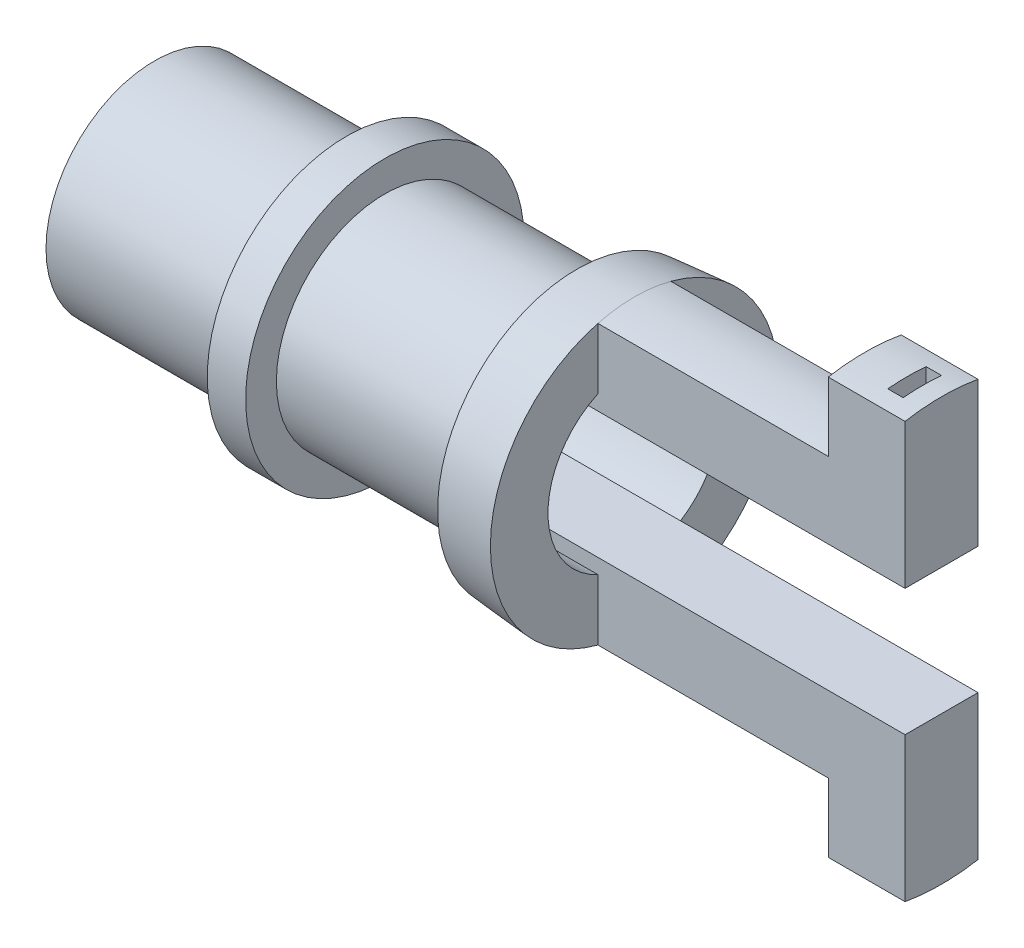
ISO-10303-21;
HEADER;
FILE_DESCRIPTION(('STEP AP214'),'2;1');
FILE_NAME('part.step','',(''),(''),'','','');
FILE_SCHEMA(('AUTOMOTIVE_DESIGN { 1 0 10303 214 1 1 1 1 }'));
ENDSEC;
DATA;
#1=APPLICATION_CONTEXT('core data for automotive mechanical design processes');
#2=APPLICATION_PROTOCOL_DEFINITION('international standard','automotive_design',2000,#1);
#3=PRODUCT_CONTEXT('',#1,'mechanical');
#4=PRODUCT('Part','Part','',(#3));
#5=PRODUCT_RELATED_PRODUCT_CATEGORY('part','',(#4));
#6=PRODUCT_DEFINITION_FORMATION('','',#4);
#7=PRODUCT_DEFINITION_CONTEXT('part definition',#1,'design');
#8=PRODUCT_DEFINITION('design','',#6,#7);
#9=PRODUCT_DEFINITION_SHAPE('','',#8);
#10=(LENGTH_UNIT() NAMED_UNIT(*) SI_UNIT(.MILLI.,.METRE.));
#11=(NAMED_UNIT(*) PLANE_ANGLE_UNIT() SI_UNIT($,.RADIAN.));
#12=(NAMED_UNIT(*) SI_UNIT($,.STERADIAN.) SOLID_ANGLE_UNIT());
#13=UNCERTAINTY_MEASURE_WITH_UNIT(LENGTH_MEASURE(1.E-05),#10,'distance_accuracy_value','');
#14=(GEOMETRIC_REPRESENTATION_CONTEXT(3) GLOBAL_UNCERTAINTY_ASSIGNED_CONTEXT((#13)) GLOBAL_UNIT_ASSIGNED_CONTEXT((#10,
#11,#12)) REPRESENTATION_CONTEXT('',''));
#15=CARTESIAN_POINT('',(0.,0.,0.));
#16=DIRECTION('',(0.,0.,1.));
#17=DIRECTION('',(1.,0.,0.));
#18=AXIS2_PLACEMENT_3D('',#15,#16,#17);
#19=CARTESIAN_POINT('',(0.,4.5,0.));
#20=DIRECTION('',(-1.,0.,0.));
#21=DIRECTION('',(0.,0.,1.));
#22=AXIS2_PLACEMENT_3D('',#19,#20,#21);
#23=PLANE('',#22);
#24=CARTESIAN_POINT('',(0.,0.,0.));
#25=DIRECTION('',(1.,0.,0.));
#26=DIRECTION('',(0.,0.,-1.));
#27=AXIS2_PLACEMENT_3D('',#24,#25,#26);
#28=CIRCLE('',#27,5.65);
#29=CARTESIAN_POINT('',(0.,0.,-5.65));
#30=VERTEX_POINT('',#29);
#31=EDGE_CURVE('E383',#30,#30,#28,.T.);
#32=ORIENTED_EDGE('',*,*,#31,.F.);
#33=EDGE_LOOP('',(#32));
#34=FACE_BOUND('',#33,.T.);
#35=CARTESIAN_POINT('',(0.,0.,0.));
#36=DIRECTION('',(1.,0.,0.));
#37=DIRECTION('',(0.,0.,-1.));
#38=AXIS2_PLACEMENT_3D('',#35,#36,#37);
#39=CIRCLE('',#38,4.5);
#40=CARTESIAN_POINT('',(0.,4.07921561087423,1.90000000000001));
#41=VERTEX_POINT('',#40);
#42=CARTESIAN_POINT('',(0.,-4.07921561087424,1.89999999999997));
#43=VERTEX_POINT('',#42);
#44=EDGE_CURVE('E381',#41,#43,#39,.T.);
#45=ORIENTED_EDGE('',*,*,#44,.T.);
#46=DIRECTION('',(0.,1.,0.));
#47=VECTOR('',#46,1.);
#48=CARTESIAN_POINT('',(0.,-3.30000000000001,1.89999999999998));
#49=LINE('',#48,#47);
#50=CARTESIAN_POINT('',(0.,-3.30000000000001,1.89999999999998));
#51=VERTEX_POINT('',#50);
#52=EDGE_CURVE('E218',#43,#51,#49,.T.);
#53=ORIENTED_EDGE('',*,*,#52,.T.);
#54=DIRECTION('',(0.,0.,-1.));
#55=VECTOR('',#54,1.);
#56=CARTESIAN_POINT('',(0.,-3.29999999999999,-1.90000000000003));
#57=LINE('',#56,#55);
#58=CARTESIAN_POINT('',(0.,-3.29999999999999,-1.90000000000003));
#59=VERTEX_POINT('',#58);
#60=EDGE_CURVE('E226',#51,#59,#57,.T.);
#61=ORIENTED_EDGE('',*,*,#60,.T.);
#62=DIRECTION('',(0.,-1.,0.));
#63=VECTOR('',#62,1.);
#64=CARTESIAN_POINT('',(0.,-4.07921561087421,-1.90000000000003));
#65=LINE('',#64,#63);
#66=CARTESIAN_POINT('',(0.,-4.07921561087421,-1.90000000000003));
#67=VERTEX_POINT('',#66);
#68=EDGE_CURVE('E229',#59,#67,#65,.T.);
#69=ORIENTED_EDGE('',*,*,#68,.T.);
#70=CARTESIAN_POINT('',(0.,4.07921561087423,-1.9));
#71=VERTEX_POINT('',#70);
#72=EDGE_CURVE('E351',#67,#71,#39,.T.);
#73=ORIENTED_EDGE('',*,*,#72,.T.);
#74=DIRECTION('',(0.,-1.,0.));
#75=VECTOR('',#74,1.);
#76=CARTESIAN_POINT('',(0.,3.3,-1.9));
#77=LINE('',#76,#75);
#78=CARTESIAN_POINT('',(0.,3.3,-1.9));
#79=VERTEX_POINT('',#78);
#80=EDGE_CURVE('E250',#71,#79,#77,.T.);
#81=ORIENTED_EDGE('',*,*,#80,.T.);
#82=DIRECTION('',(0.,0.,1.));
#83=VECTOR('',#82,1.);
#84=CARTESIAN_POINT('',(0.,3.3,1.90000000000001));
#85=LINE('',#84,#83);
#86=CARTESIAN_POINT('',(0.,3.3,1.90000000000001));
#87=VERTEX_POINT('',#86);
#88=EDGE_CURVE('E247',#79,#87,#85,.T.);
#89=ORIENTED_EDGE('',*,*,#88,.T.);
#90=DIRECTION('',(0.,1.,0.));
#91=VECTOR('',#90,1.);
#92=CARTESIAN_POINT('',(0.,4.07921561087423,1.90000000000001));
#93=LINE('',#92,#91);
#94=EDGE_CURVE('E244',#87,#41,#93,.T.);
#95=ORIENTED_EDGE('',*,*,#94,.T.);
#96=EDGE_LOOP('',(#45,#53,#61,#69,#73,#81,#89,#95));
#97=FACE_BOUND('',#96,.T.);
#98=DIRECTION('',(0.,0.,1.));
#99=VECTOR('',#98,1.);
#100=CARTESIAN_POINT('',(0.,4.,0.));
#101=LINE('',#100,#99);
#102=CARTESIAN_POINT('',(0.,4.,-1.));
#103=VERTEX_POINT('',#102);
#104=CARTESIAN_POINT('',(0.,4.,1.));
#105=VERTEX_POINT('',#104);
#106=EDGE_CURVE('E11',#103,#105,#101,.T.);
#107=ORIENTED_EDGE('',*,*,#106,.F.);
#108=DIRECTION('',(0.,1.,0.));
#109=VECTOR('',#108,1.);
#110=CARTESIAN_POINT('',(0.,4.5,-1.));
#111=LINE('',#110,#109);
#112=CARTESIAN_POINT('',(0.,4.8,-1.));
#113=VERTEX_POINT('',#112);
#114=EDGE_CURVE('E216',#103,#113,#111,.T.);
#115=ORIENTED_EDGE('',*,*,#114,.T.);
#116=DIRECTION('',(0.,0.,-1.));
#117=VECTOR('',#116,1.);
#118=CARTESIAN_POINT('',(0.,4.8,0.));
#119=LINE('',#118,#117);
#120=CARTESIAN_POINT('',(0.,4.8,1.));
#121=VERTEX_POINT('',#120);
#122=EDGE_CURVE('E39',#121,#113,#119,.T.);
#123=ORIENTED_EDGE('',*,*,#122,.F.);
#124=DIRECTION('',(0.,1.,0.));
#125=VECTOR('',#124,1.);
#126=CARTESIAN_POINT('',(0.,4.5,1.));
#127=LINE('',#126,#125);
#128=EDGE_CURVE('E213',#105,#121,#127,.T.);
#129=ORIENTED_EDGE('',*,*,#128,.F.);
#130=EDGE_LOOP('',(#107,#115,#123,#129));
#131=FACE_BOUND('',#130,.T.);
#132=ADVANCED_FACE('F31',(#34,#97,#131),#23,.T.);
#133=CARTESIAN_POINT('',(41.,0.,0.));
#134=DIRECTION('',(-1.,0.,0.));
#135=DIRECTION('',(0.,0.,1.));
#136=AXIS2_PLACEMENT_3D('',#133,#134,#135);
#137=CYLINDRICAL_SURFACE('',#136,11.);
#138=CARTESIAN_POINT('',(37.,0.,0.));
#139=DIRECTION('',(1.,0.,0.));
#140=DIRECTION('',(0.,0.,-1.));
#141=AXIS2_PLACEMENT_3D('',#138,#139,#140);
#142=CIRCLE('',#141,11.);
#143=CARTESIAN_POINT('',(37.,10.8346665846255,-1.9));
#144=VERTEX_POINT('',#143);
#145=CARTESIAN_POINT('',(37.,10.8346665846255,1.9));
#146=VERTEX_POINT('',#145);
#147=EDGE_CURVE('E310',#144,#146,#142,.T.);
#148=ORIENTED_EDGE('',*,*,#147,.T.);
#149=DIRECTION('',(-1.,0.,0.));
#150=VECTOR('',#149,1.);
#151=CARTESIAN_POINT('',(41.,10.8346665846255,1.9));
#152=LINE('',#151,#150);
#153=CARTESIAN_POINT('',(41.,10.8346665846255,1.9));
#154=VERTEX_POINT('',#153);
#155=EDGE_CURVE('E307',#154,#146,#152,.T.);
#156=ORIENTED_EDGE('',*,*,#155,.F.);
#157=CARTESIAN_POINT('',(41.,0.,0.));
#158=DIRECTION('',(1.,0.,0.));
#159=DIRECTION('',(0.,0.,-1.));
#160=AXIS2_PLACEMENT_3D('',#157,#158,#159);
#161=CIRCLE('',#160,11.);
#162=CARTESIAN_POINT('',(41.,10.8346665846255,-1.9));
#163=VERTEX_POINT('',#162);
#164=EDGE_CURVE('E302',#163,#154,#161,.T.);
#165=ORIENTED_EDGE('',*,*,#164,.F.);
#166=DIRECTION('',(-1.,0.,0.));
#167=VECTOR('',#166,1.);
#168=CARTESIAN_POINT('',(41.,10.8346665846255,-1.9));
#169=LINE('',#168,#167);
#170=EDGE_CURVE('E355',#163,#144,#169,.T.);
#171=ORIENTED_EDGE('',*,*,#170,.T.);
#172=EDGE_LOOP('',(#148,#156,#165,#171));
#173=FACE_BOUND('',#172,.T.);
#174=DIRECTION('',(-1.,0.,0.));
#175=VECTOR('',#174,1.);
#176=CARTESIAN_POINT('',(41.,10.9544511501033,-1.));
#177=LINE('',#176,#175);
#178=CARTESIAN_POINT('',(40.,10.9544511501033,-1.));
#179=VERTEX_POINT('',#178);
#180=CARTESIAN_POINT('',(39.2,10.9544511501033,-1.));
#181=VERTEX_POINT('',#180);
#182=EDGE_CURVE('E186',#179,#181,#177,.T.);
#183=ORIENTED_EDGE('',*,*,#182,.F.);
#184=CARTESIAN_POINT('',(40.,0.,0.));
#185=DIRECTION('',(1.,0.,0.));
#186=DIRECTION('',(0.,0.,-1.));
#187=AXIS2_PLACEMENT_3D('',#184,#185,#186);
#188=CIRCLE('',#187,11.);
#189=CARTESIAN_POINT('',(40.,10.9544511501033,1.));
#190=VERTEX_POINT('',#189);
#191=EDGE_CURVE('E392',#179,#190,#188,.T.);
#192=ORIENTED_EDGE('',*,*,#191,.T.);
#193=DIRECTION('',(-1.,0.,0.));
#194=VECTOR('',#193,1.);
#195=CARTESIAN_POINT('',(41.,10.9544511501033,1.));
#196=LINE('',#195,#194);
#197=CARTESIAN_POINT('',(39.2,10.9544511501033,1.));
#198=VERTEX_POINT('',#197);
#199=EDGE_CURVE('E385',#190,#198,#196,.T.);
#200=ORIENTED_EDGE('',*,*,#199,.T.);
#201=CARTESIAN_POINT('',(39.2,0.,0.));
#202=DIRECTION('',(-1.,0.,0.));
#203=DIRECTION('',(0.,0.,1.));
#204=AXIS2_PLACEMENT_3D('',#201,#202,#203);
#205=CIRCLE('',#204,11.);
#206=EDGE_CURVE('E389',#198,#181,#205,.T.);
#207=ORIENTED_EDGE('',*,*,#206,.T.);
#208=EDGE_LOOP('',(#183,#192,#200,#207));
#209=FACE_BOUND('',#208,.T.);
#210=ADVANCED_FACE('F396',(#173,#209),#137,.T.);
#211=CARTESIAN_POINT('',(0.,0.,0.));
#212=DIRECTION('',(1.,0.,0.));
#213=DIRECTION('',(0.,0.,-1.));
#214=AXIS2_PLACEMENT_3D('',#211,#212,#213);
#215=CYLINDRICAL_SURFACE('',#214,4.5);
#216=DIRECTION('',(-1.,0.,0.));
#217=VECTOR('',#216,1.);
#218=CARTESIAN_POINT('',(44.9849717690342,-4.07921561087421,-1.90000000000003));
#219=LINE('',#218,#217);
#220=CARTESIAN_POINT('',(25.,-4.07921561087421,-1.90000000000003));
#221=VERTEX_POINT('',#220);
#222=EDGE_CURVE('E223',#221,#67,#219,.T.);
#223=ORIENTED_EDGE('',*,*,#222,.F.);
#224=CARTESIAN_POINT('',(25.,0.,0.));
#225=DIRECTION('',(1.,0.,0.));
#226=DIRECTION('',(0.,0.,-1.));
#227=AXIS2_PLACEMENT_3D('',#224,#225,#226);
#228=CIRCLE('',#227,4.5);
#229=CARTESIAN_POINT('',(25.,4.07921561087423,-1.9));
#230=VERTEX_POINT('',#229);
#231=EDGE_CURVE('E334',#221,#230,#228,.T.);
#232=ORIENTED_EDGE('',*,*,#231,.T.);
#233=DIRECTION('',(-1.,0.,0.));
#234=VECTOR('',#233,1.);
#235=CARTESIAN_POINT('',(44.9849717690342,4.07921561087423,-1.9));
#236=LINE('',#235,#234);
#237=EDGE_CURVE('E222',#230,#71,#236,.T.);
#238=ORIENTED_EDGE('',*,*,#237,.T.);
#239=ORIENTED_EDGE('',*,*,#72,.F.);
#240=EDGE_LOOP('',(#223,#232,#238,#239));
#241=FACE_BOUND('',#240,.T.);
#242=ADVANCED_FACE('F421',(#241),#215,.F.);
#243=CARTESIAN_POINT('',(25.,7.5,0.));
#244=DIRECTION('',(1.,0.,0.));
#245=DIRECTION('',(0.,0.,-1.));
#246=AXIS2_PLACEMENT_3D('',#243,#244,#245);
#247=PLANE('',#246);
#248=CARTESIAN_POINT('',(25.,0.,0.));
#249=DIRECTION('',(1.,0.,0.));
#250=DIRECTION('',(0.,0.,-1.));
#251=AXIS2_PLACEMENT_3D('',#248,#249,#250);
#252=CIRCLE('',#251,7.5);
#253=CARTESIAN_POINT('',(25.,7.25534285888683,1.9));
#254=VERTEX_POINT('',#253);
#255=CARTESIAN_POINT('',(25.,-7.25534285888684,1.89999999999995));
#256=VERTEX_POINT('',#255);
#257=EDGE_CURVE('E332',#254,#256,#252,.T.);
#258=ORIENTED_EDGE('',*,*,#257,.T.);
#259=DIRECTION('',(0.,-1.,0.));
#260=VECTOR('',#259,1.);
#261=CARTESIAN_POINT('',(25.,-4.07921561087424,1.89999999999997));
#262=LINE('',#261,#260);
#263=CARTESIAN_POINT('',(25.,-4.07921561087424,1.89999999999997));
#264=VERTEX_POINT('',#263);
#265=EDGE_CURVE('E281',#264,#256,#262,.T.);
#266=ORIENTED_EDGE('',*,*,#265,.F.);
#267=CARTESIAN_POINT('',(25.,4.07921561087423,1.90000000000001));
#268=VERTEX_POINT('',#267);
#269=EDGE_CURVE('E347',#268,#264,#228,.T.);
#270=ORIENTED_EDGE('',*,*,#269,.F.);
#271=DIRECTION('',(0.,-1.,0.));
#272=VECTOR('',#271,1.);
#273=CARTESIAN_POINT('',(25.,7.25534285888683,1.9));
#274=LINE('',#273,#272);
#275=EDGE_CURVE('E326',#254,#268,#274,.T.);
#276=ORIENTED_EDGE('',*,*,#275,.F.);
#277=EDGE_LOOP('',(#258,#266,#270,#276));
#278=FACE_BOUND('',#277,.T.);
#279=ADVANCED_FACE('F431',(#278),#247,.T.);
#280=ORIENTED_EDGE('',*,*,#231,.F.);
#281=DIRECTION('',(0.,1.,0.));
#282=VECTOR('',#281,1.);
#283=CARTESIAN_POINT('',(25.,-7.25534285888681,-1.90000000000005));
#284=LINE('',#283,#282);
#285=CARTESIAN_POINT('',(25.,-7.25534285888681,-1.90000000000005));
#286=VERTEX_POINT('',#285);
#287=EDGE_CURVE('E286',#286,#221,#284,.T.);
#288=ORIENTED_EDGE('',*,*,#287,.F.);
#289=CARTESIAN_POINT('',(25.,7.25534285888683,-1.9));
#290=VERTEX_POINT('',#289);
#291=EDGE_CURVE('E329',#286,#290,#252,.T.);
#292=ORIENTED_EDGE('',*,*,#291,.T.);
#293=DIRECTION('',(0.,1.,0.));
#294=VECTOR('',#293,1.);
#295=CARTESIAN_POINT('',(25.,4.07921561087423,-1.9));
#296=LINE('',#295,#294);
#297=EDGE_CURVE('E352',#230,#290,#296,.T.);
#298=ORIENTED_EDGE('',*,*,#297,.F.);
#299=EDGE_LOOP('',(#280,#288,#292,#298));
#300=FACE_BOUND('',#299,.T.);
#301=ADVANCED_FACE('F434',(#300),#247,.T.);
#302=CARTESIAN_POINT('',(0.,0.,0.));
#303=DIRECTION('',(1.,0.,0.));
#304=DIRECTION('',(0.,0.,-1.));
#305=AXIS2_PLACEMENT_3D('',#302,#303,#304);
#306=CYLINDRICAL_SURFACE('',#305,5.65);
#307=ORIENTED_EDGE('',*,*,#31,.T.);
#308=EDGE_LOOP('',(#307));
#309=FACE_BOUND('',#308,.T.);
#310=CARTESIAN_POINT('',(10.,0.,0.));
#311=DIRECTION('',(1.,0.,0.));
#312=DIRECTION('',(0.,0.,-1.));
#313=AXIS2_PLACEMENT_3D('',#310,#311,#312);
#314=CIRCLE('',#313,5.65);
#315=CARTESIAN_POINT('',(10.,0.,-5.65));
#316=VERTEX_POINT('',#315);
#317=EDGE_CURVE('E359',#316,#316,#314,.T.);
#318=ORIENTED_EDGE('',*,*,#317,.F.);
#319=EDGE_LOOP('',(#318));
#320=FACE_BOUND('',#319,.T.);
#321=ADVANCED_FACE('F33',(#309,#320),#306,.T.);
#322=DIRECTION('',(-1.,0.,0.));
#323=VECTOR('',#322,1.);
#324=CARTESIAN_POINT('',(44.9849717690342,-4.07921561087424,1.89999999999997));
#325=LINE('',#324,#323);
#326=EDGE_CURVE('E232',#264,#43,#325,.T.);
#327=ORIENTED_EDGE('',*,*,#326,.T.);
#328=ORIENTED_EDGE('',*,*,#44,.F.);
#329=DIRECTION('',(-1.,0.,0.));
#330=VECTOR('',#329,1.);
#331=CARTESIAN_POINT('',(44.9849717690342,4.07921561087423,1.90000000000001));
#332=LINE('',#331,#330);
#333=EDGE_CURVE('E259',#268,#41,#332,.T.);
#334=ORIENTED_EDGE('',*,*,#333,.F.);
#335=ORIENTED_EDGE('',*,*,#269,.T.);
#336=EDGE_LOOP('',(#327,#328,#334,#335));
#337=FACE_BOUND('',#336,.T.);
#338=ADVANCED_FACE('F426',(#337),#215,.F.);
#339=CARTESIAN_POINT('',(25.,0.,0.));
#340=DIRECTION('',(1.,0.,0.));
#341=DIRECTION('',(0.,0.,-1.));
#342=AXIS2_PLACEMENT_3D('',#339,#340,#341);
#343=CONICAL_SURFACE('',#342,7.5,0.0831412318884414);
#344=CARTESIAN_POINT('',(22.,0.,0.));
#345=DIRECTION('',(1.,0.,0.));
#346=DIRECTION('',(0.,0.,-1.));
#347=AXIS2_PLACEMENT_3D('',#344,#345,#346);
#348=CIRCLE('',#347,7.25);
#349=CARTESIAN_POINT('',(22.,0.,-7.25));
#350=VERTEX_POINT('',#349);
#351=EDGE_CURVE('E333',#350,#350,#348,.T.);
#352=ORIENTED_EDGE('',*,*,#351,.T.);
#353=EDGE_LOOP('',(#352));
#354=FACE_BOUND('',#353,.T.);
#355=EDGE_CURVE('E340',#290,#254,#252,.T.);
#356=ORIENTED_EDGE('',*,*,#355,.F.);
#357=ORIENTED_EDGE('',*,*,#291,.F.);
#358=CARTESIAN_POINT('',(25.,0.,0.));
#359=DIRECTION('',(1.,0.,0.));
#360=DIRECTION('',(0.,0.,1.));
#361=AXIS2_PLACEMENT_3D('',#358,#359,#360);
#362=CIRCLE('',#361,7.5);
#363=EDGE_CURVE('E289',#256,#286,#362,.T.);
#364=ORIENTED_EDGE('',*,*,#363,.F.);
#365=ORIENTED_EDGE('',*,*,#257,.F.);
#366=EDGE_LOOP('',(#356,#357,#364,#365));
#367=FACE_BOUND('',#366,.T.);
#368=ADVANCED_FACE('F429',(#354,#367),#343,.T.);
#369=CARTESIAN_POINT('',(22.,5.65,0.));
#370=DIRECTION('',(-1.,0.,0.));
#371=DIRECTION('',(0.,0.,1.));
#372=AXIS2_PLACEMENT_3D('',#369,#370,#371);
#373=PLANE('',#372);
#374=CARTESIAN_POINT('',(22.,0.,0.));
#375=DIRECTION('',(1.,0.,0.));
#376=DIRECTION('',(0.,0.,-1.));
#377=AXIS2_PLACEMENT_3D('',#374,#375,#376);
#378=CIRCLE('',#377,5.65);
#379=CARTESIAN_POINT('',(22.,0.,-5.65));
#380=VERTEX_POINT('',#379);
#381=EDGE_CURVE('E376',#380,#380,#378,.T.);
#382=ORIENTED_EDGE('',*,*,#381,.T.);
#383=EDGE_LOOP('',(#382));
#384=FACE_BOUND('',#383,.T.);
#385=ORIENTED_EDGE('',*,*,#351,.F.);
#386=EDGE_LOOP('',(#385));
#387=FACE_BOUND('',#386,.T.);
#388=ADVANCED_FACE('F438',(#384,#387),#373,.T.);
#389=CARTESIAN_POINT('',(0.,0.,0.));
#390=DIRECTION('',(1.,0.,0.));
#391=DIRECTION('',(0.,0.,-1.));
#392=AXIS2_PLACEMENT_3D('',#389,#390,#391);
#393=CYLINDRICAL_SURFACE('',#392,5.65);
#394=CARTESIAN_POINT('',(12.,0.,0.));
#395=DIRECTION('',(1.,0.,0.));
#396=DIRECTION('',(0.,0.,-1.));
#397=AXIS2_PLACEMENT_3D('',#394,#395,#396);
#398=CIRCLE('',#397,5.65);
#399=CARTESIAN_POINT('',(12.,0.,-5.65));
#400=VERTEX_POINT('',#399);
#401=EDGE_CURVE('E373',#400,#400,#398,.T.);
#402=ORIENTED_EDGE('',*,*,#401,.T.);
#403=EDGE_LOOP('',(#402));
#404=FACE_BOUND('',#403,.T.);
#405=ORIENTED_EDGE('',*,*,#381,.F.);
#406=EDGE_LOOP('',(#405));
#407=FACE_BOUND('',#406,.T.);
#408=ADVANCED_FACE('F442',(#404,#407),#393,.T.);
#409=CARTESIAN_POINT('',(12.,7.25,0.));
#410=DIRECTION('',(1.,0.,0.));
#411=DIRECTION('',(0.,0.,-1.));
#412=AXIS2_PLACEMENT_3D('',#409,#410,#411);
#413=PLANE('',#412);
#414=CARTESIAN_POINT('',(12.,0.,0.));
#415=DIRECTION('',(1.,0.,0.));
#416=DIRECTION('',(0.,0.,-1.));
#417=AXIS2_PLACEMENT_3D('',#414,#415,#416);
#418=CIRCLE('',#417,7.25);
#419=CARTESIAN_POINT('',(12.,0.,-7.25));
#420=VERTEX_POINT('',#419);
#421=EDGE_CURVE('E370',#420,#420,#418,.T.);
#422=ORIENTED_EDGE('',*,*,#421,.T.);
#423=EDGE_LOOP('',(#422));
#424=FACE_BOUND('',#423,.T.);
#425=ORIENTED_EDGE('',*,*,#401,.F.);
#426=EDGE_LOOP('',(#425));
#427=FACE_BOUND('',#426,.T.);
#428=ADVANCED_FACE('F446',(#424,#427),#413,.T.);
#429=CARTESIAN_POINT('',(0.,0.,0.));
#430=DIRECTION('',(1.,0.,0.));
#431=DIRECTION('',(0.,0.,-1.));
#432=AXIS2_PLACEMENT_3D('',#429,#430,#431);
#433=CYLINDRICAL_SURFACE('',#432,7.25);
#434=CARTESIAN_POINT('',(10.,0.,0.));
#435=DIRECTION('',(1.,0.,0.));
#436=DIRECTION('',(0.,0.,-1.));
#437=AXIS2_PLACEMENT_3D('',#434,#435,#436);
#438=CIRCLE('',#437,7.25);
#439=CARTESIAN_POINT('',(10.,0.,-7.25));
#440=VERTEX_POINT('',#439);
#441=EDGE_CURVE('E367',#440,#440,#438,.T.);
#442=ORIENTED_EDGE('',*,*,#441,.T.);
#443=EDGE_LOOP('',(#442));
#444=FACE_BOUND('',#443,.T.);
#445=ORIENTED_EDGE('',*,*,#421,.F.);
#446=EDGE_LOOP('',(#445));
#447=FACE_BOUND('',#446,.T.);
#448=ADVANCED_FACE('F450',(#444,#447),#433,.T.);
#449=CARTESIAN_POINT('',(10.,5.65,0.));
#450=DIRECTION('',(-1.,0.,0.));
#451=DIRECTION('',(0.,0.,1.));
#452=AXIS2_PLACEMENT_3D('',#449,#450,#451);
#453=PLANE('',#452);
#454=ORIENTED_EDGE('',*,*,#317,.T.);
#455=EDGE_LOOP('',(#454));
#456=FACE_BOUND('',#455,.T.);
#457=ORIENTED_EDGE('',*,*,#441,.F.);
#458=EDGE_LOOP('',(#457));
#459=FACE_BOUND('',#458,.T.);
#460=ADVANCED_FACE('F454',(#456,#459),#453,.T.);
#461=CARTESIAN_POINT('',(37.,4.07921561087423,-1.9));
#462=DIRECTION('',(0.,0.,1.));
#463=DIRECTION('',(0.,-1.,0.));
#464=AXIS2_PLACEMENT_3D('',#461,#462,#463);
#465=PLANE('',#464);
#466=ORIENTED_EDGE('',*,*,#297,.T.);
#467=DIRECTION('',(-1.,0.,0.));
#468=VECTOR('',#467,1.);
#469=CARTESIAN_POINT('',(37.,7.25534285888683,-1.9));
#470=LINE('',#469,#468);
#471=CARTESIAN_POINT('',(37.,7.25534285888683,-1.9));
#472=VERTEX_POINT('',#471);
#473=EDGE_CURVE('E356',#472,#290,#470,.T.);
#474=ORIENTED_EDGE('',*,*,#473,.F.);
#475=DIRECTION('',(0.,1.,0.));
#476=VECTOR('',#475,1.);
#477=CARTESIAN_POINT('',(37.,10.8346665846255,-1.9));
#478=LINE('',#477,#476);
#479=EDGE_CURVE('E299',#472,#144,#478,.T.);
#480=ORIENTED_EDGE('',*,*,#479,.T.);
#481=ORIENTED_EDGE('',*,*,#170,.F.);
#482=DIRECTION('',(0.,1.,0.));
#483=VECTOR('',#482,1.);
#484=CARTESIAN_POINT('',(41.,10.8346665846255,-1.9));
#485=LINE('',#484,#483);
#486=CARTESIAN_POINT('',(41.,3.3,-1.9));
#487=VERTEX_POINT('',#486);
#488=EDGE_CURVE('E300',#487,#163,#485,.T.);
#489=ORIENTED_EDGE('',*,*,#488,.F.);
#490=DIRECTION('',(-1.,0.,0.));
#491=VECTOR('',#490,1.);
#492=CARTESIAN_POINT('',(44.9849717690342,3.3,-1.9));
#493=LINE('',#492,#491);
#494=EDGE_CURVE('E253',#487,#79,#493,.T.);
#495=ORIENTED_EDGE('',*,*,#494,.T.);
#496=ORIENTED_EDGE('',*,*,#80,.F.);
#497=ORIENTED_EDGE('',*,*,#237,.F.);
#498=EDGE_LOOP('',(#466,#474,#480,#481,#489,#495,#496,#497));
#499=FACE_BOUND('',#498,.T.);
#500=ADVANCED_FACE('F458',(#499),#465,.F.);
#501=CARTESIAN_POINT('',(37.,0.,0.));
#502=DIRECTION('',(-1.,0.,0.));
#503=DIRECTION('',(0.,0.,1.));
#504=AXIS2_PLACEMENT_3D('',#501,#502,#503);
#505=CYLINDRICAL_SURFACE('',#504,7.5);
#506=ORIENTED_EDGE('',*,*,#355,.T.);
#507=DIRECTION('',(-1.,0.,0.));
#508=VECTOR('',#507,1.);
#509=CARTESIAN_POINT('',(37.,7.25534285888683,1.9));
#510=LINE('',#509,#508);
#511=CARTESIAN_POINT('',(37.,7.25534285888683,1.9));
#512=VERTEX_POINT('',#511);
#513=EDGE_CURVE('E325',#512,#254,#510,.T.);
#514=ORIENTED_EDGE('',*,*,#513,.F.);
#515=CARTESIAN_POINT('',(37.,0.,0.));
#516=DIRECTION('',(1.,0.,0.));
#517=DIRECTION('',(0.,0.,-1.));
#518=AXIS2_PLACEMENT_3D('',#515,#516,#517);
#519=CIRCLE('',#518,7.5);
#520=EDGE_CURVE('E321',#472,#512,#519,.T.);
#521=ORIENTED_EDGE('',*,*,#520,.F.);
#522=ORIENTED_EDGE('',*,*,#473,.T.);
#523=EDGE_LOOP('',(#506,#514,#521,#522));
#524=FACE_BOUND('',#523,.T.);
#525=ADVANCED_FACE('F462',(#524),#505,.T.);
#526=CARTESIAN_POINT('',(37.,7.25534285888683,1.9));
#527=DIRECTION('',(0.,0.,-1.));
#528=DIRECTION('',(0.,1.,0.));
#529=AXIS2_PLACEMENT_3D('',#526,#527,#528);
#530=PLANE('',#529);
#531=ORIENTED_EDGE('',*,*,#275,.T.);
#532=ORIENTED_EDGE('',*,*,#333,.T.);
#533=ORIENTED_EDGE('',*,*,#94,.F.);
#534=DIRECTION('',(-1.,0.,0.));
#535=VECTOR('',#534,1.);
#536=CARTESIAN_POINT('',(44.9849717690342,3.3,1.90000000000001));
#537=LINE('',#536,#535);
#538=CARTESIAN_POINT('',(41.,3.3,1.90000000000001));
#539=VERTEX_POINT('',#538);
#540=EDGE_CURVE('E256',#539,#87,#537,.T.);
#541=ORIENTED_EDGE('',*,*,#540,.F.);
#542=DIRECTION('',(0.,-1.,0.));
#543=VECTOR('',#542,1.);
#544=CARTESIAN_POINT('',(41.,10.8346665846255,1.9));
#545=LINE('',#544,#543);
#546=EDGE_CURVE('E305',#154,#539,#545,.T.);
#547=ORIENTED_EDGE('',*,*,#546,.F.);
#548=ORIENTED_EDGE('',*,*,#155,.T.);
#549=DIRECTION('',(0.,-1.,0.));
#550=VECTOR('',#549,1.);
#551=CARTESIAN_POINT('',(37.,10.8346665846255,1.9));
#552=LINE('',#551,#550);
#553=EDGE_CURVE('E303',#146,#512,#552,.T.);
#554=ORIENTED_EDGE('',*,*,#553,.T.);
#555=ORIENTED_EDGE('',*,*,#513,.T.);
#556=EDGE_LOOP('',(#531,#532,#533,#541,#547,#548,#554,#555));
#557=FACE_BOUND('',#556,.T.);
#558=ADVANCED_FACE('F466',(#557),#530,.F.);
#559=CARTESIAN_POINT('',(37.,0.,0.));
#560=DIRECTION('',(1.,0.,0.));
#561=DIRECTION('',(0.,0.,-1.));
#562=AXIS2_PLACEMENT_3D('',#559,#560,#561);
#563=PLANE('',#562);
#564=ORIENTED_EDGE('',*,*,#479,.F.);
#565=ORIENTED_EDGE('',*,*,#520,.T.);
#566=ORIENTED_EDGE('',*,*,#553,.F.);
#567=ORIENTED_EDGE('',*,*,#147,.F.);
#568=EDGE_LOOP('',(#564,#565,#566,#567));
#569=FACE_BOUND('',#568,.T.);
#570=ADVANCED_FACE('F469',(#569),#563,.F.);
#571=CARTESIAN_POINT('',(41.,0.,0.));
#572=DIRECTION('',(1.,0.,0.));
#573=DIRECTION('',(0.,0.,-1.));
#574=AXIS2_PLACEMENT_3D('',#571,#572,#573);
#575=PLANE('',#574);
#576=ORIENTED_EDGE('',*,*,#546,.T.);
#577=DIRECTION('',(0.,0.,-1.));
#578=VECTOR('',#577,1.);
#579=CARTESIAN_POINT('',(41.,3.3,1.90000000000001));
#580=LINE('',#579,#578);
#581=EDGE_CURVE('E240',#539,#487,#580,.T.);
#582=ORIENTED_EDGE('',*,*,#581,.T.);
#583=ORIENTED_EDGE('',*,*,#488,.T.);
#584=ORIENTED_EDGE('',*,*,#164,.T.);
#585=EDGE_LOOP('',(#576,#582,#583,#584));
#586=FACE_BOUND('',#585,.T.);
#587=ADVANCED_FACE('F474',(#586),#575,.T.);
#588=CARTESIAN_POINT('',(37.,-4.07921561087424,1.89999999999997));
#589=DIRECTION('',(0.,0.,-1.));
#590=DIRECTION('',(0.,1.,0.));
#591=AXIS2_PLACEMENT_3D('',#588,#589,#590);
#592=PLANE('',#591);
#593=ORIENTED_EDGE('',*,*,#265,.T.);
#594=DIRECTION('',(-1.,0.,0.));
#595=VECTOR('',#594,1.);
#596=CARTESIAN_POINT('',(37.,-7.25534285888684,1.89999999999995));
#597=LINE('',#596,#595);
#598=CARTESIAN_POINT('',(37.,-7.25534285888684,1.89999999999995));
#599=VERTEX_POINT('',#598);
#600=EDGE_CURVE('E296',#599,#256,#597,.T.);
#601=ORIENTED_EDGE('',*,*,#600,.F.);
#602=DIRECTION('',(0.,-1.,0.));
#603=VECTOR('',#602,1.);
#604=CARTESIAN_POINT('',(37.,-10.8346665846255,1.89999999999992));
#605=LINE('',#604,#603);
#606=CARTESIAN_POINT('',(37.,-10.8346665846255,1.89999999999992));
#607=VERTEX_POINT('',#606);
#608=EDGE_CURVE('E243',#599,#607,#605,.T.);
#609=ORIENTED_EDGE('',*,*,#608,.T.);
#610=DIRECTION('',(-1.,0.,0.));
#611=VECTOR('',#610,1.);
#612=CARTESIAN_POINT('',(41.,-10.8346665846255,1.89999999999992));
#613=LINE('',#612,#611);
#614=CARTESIAN_POINT('',(41.,-10.8346665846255,1.89999999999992));
#615=VERTEX_POINT('',#614);
#616=EDGE_CURVE('E278',#615,#607,#613,.T.);
#617=ORIENTED_EDGE('',*,*,#616,.F.);
#618=DIRECTION('',(0.,-1.,0.));
#619=VECTOR('',#618,1.);
#620=CARTESIAN_POINT('',(41.,-10.8346665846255,1.89999999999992));
#621=LINE('',#620,#619);
#622=CARTESIAN_POINT('',(41.,-3.30000000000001,1.89999999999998));
#623=VERTEX_POINT('',#622);
#624=EDGE_CURVE('E263',#623,#615,#621,.T.);
#625=ORIENTED_EDGE('',*,*,#624,.F.);
#626=DIRECTION('',(-1.,0.,0.));
#627=VECTOR('',#626,1.);
#628=CARTESIAN_POINT('',(44.9849717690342,-3.30000000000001,1.89999999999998));
#629=LINE('',#628,#627);
#630=EDGE_CURVE('E236',#623,#51,#629,.T.);
#631=ORIENTED_EDGE('',*,*,#630,.T.);
#632=ORIENTED_EDGE('',*,*,#52,.F.);
#633=ORIENTED_EDGE('',*,*,#326,.F.);
#634=EDGE_LOOP('',(#593,#601,#609,#617,#625,#631,#632,#633));
#635=FACE_BOUND('',#634,.T.);
#636=ADVANCED_FACE('F478',(#635),#592,.F.);
#637=CARTESIAN_POINT('',(37.,0.,0.));
#638=DIRECTION('',(-1.,0.,0.));
#639=DIRECTION('',(0.,0.,1.));
#640=AXIS2_PLACEMENT_3D('',#637,#638,#639);
#641=CYLINDRICAL_SURFACE('',#640,7.5);
#642=ORIENTED_EDGE('',*,*,#363,.T.);
#643=DIRECTION('',(-1.,0.,0.));
#644=VECTOR('',#643,1.);
#645=CARTESIAN_POINT('',(37.,-7.25534285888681,-1.90000000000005));
#646=LINE('',#645,#644);
#647=CARTESIAN_POINT('',(37.,-7.25534285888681,-1.90000000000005));
#648=VERTEX_POINT('',#647);
#649=EDGE_CURVE('E285',#648,#286,#646,.T.);
#650=ORIENTED_EDGE('',*,*,#649,.F.);
#651=CARTESIAN_POINT('',(37.,0.,0.));
#652=DIRECTION('',(1.,0.,0.));
#653=DIRECTION('',(0.,0.,1.));
#654=AXIS2_PLACEMENT_3D('',#651,#652,#653);
#655=CIRCLE('',#654,7.5);
#656=EDGE_CURVE('E282',#599,#648,#655,.T.);
#657=ORIENTED_EDGE('',*,*,#656,.F.);
#658=ORIENTED_EDGE('',*,*,#600,.T.);
#659=EDGE_LOOP('',(#642,#650,#657,#658));
#660=FACE_BOUND('',#659,.T.);
#661=ADVANCED_FACE('F482',(#660),#641,.T.);
#662=CARTESIAN_POINT('',(37.,-7.25534285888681,-1.90000000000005));
#663=DIRECTION('',(0.,0.,1.));
#664=DIRECTION('',(0.,-1.,0.));
#665=AXIS2_PLACEMENT_3D('',#662,#663,#664);
#666=PLANE('',#665);
#667=ORIENTED_EDGE('',*,*,#287,.T.);
#668=ORIENTED_EDGE('',*,*,#222,.T.);
#669=ORIENTED_EDGE('',*,*,#68,.F.);
#670=DIRECTION('',(-1.,0.,0.));
#671=VECTOR('',#670,1.);
#672=CARTESIAN_POINT('',(44.9849717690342,-3.29999999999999,-1.90000000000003));
#673=LINE('',#672,#671);
#674=CARTESIAN_POINT('',(41.,-3.29999999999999,-1.90000000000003));
#675=VERTEX_POINT('',#674);
#676=EDGE_CURVE('E234',#675,#59,#673,.T.);
#677=ORIENTED_EDGE('',*,*,#676,.F.);
#678=DIRECTION('',(0.,1.,0.));
#679=VECTOR('',#678,1.);
#680=CARTESIAN_POINT('',(41.,-10.8346665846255,-1.90000000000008));
#681=LINE('',#680,#679);
#682=CARTESIAN_POINT('',(41.,-10.8346665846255,-1.90000000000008));
#683=VERTEX_POINT('',#682);
#684=EDGE_CURVE('E268',#683,#675,#681,.T.);
#685=ORIENTED_EDGE('',*,*,#684,.F.);
#686=DIRECTION('',(-1.,0.,0.));
#687=VECTOR('',#686,1.);
#688=CARTESIAN_POINT('',(41.,-10.8346665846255,-1.90000000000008));
#689=LINE('',#688,#687);
#690=CARTESIAN_POINT('',(37.,-10.8346665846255,-1.90000000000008));
#691=VERTEX_POINT('',#690);
#692=EDGE_CURVE('E270',#683,#691,#689,.T.);
#693=ORIENTED_EDGE('',*,*,#692,.T.);
#694=DIRECTION('',(0.,1.,0.));
#695=VECTOR('',#694,1.);
#696=CARTESIAN_POINT('',(37.,-10.8346665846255,-1.90000000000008));
#697=LINE('',#696,#695);
#698=EDGE_CURVE('E266',#691,#648,#697,.T.);
#699=ORIENTED_EDGE('',*,*,#698,.T.);
#700=ORIENTED_EDGE('',*,*,#649,.T.);
#701=EDGE_LOOP('',(#667,#668,#669,#677,#685,#693,#699,#700));
#702=FACE_BOUND('',#701,.T.);
#703=ADVANCED_FACE('F486',(#702),#666,.F.);
#704=CARTESIAN_POINT('',(37.,0.,0.));
#705=DIRECTION('',(1.,0.,0.));
#706=DIRECTION('',(0.,0.,1.));
#707=AXIS2_PLACEMENT_3D('',#704,#705,#706);
#708=PLANE('',#707);
#709=ORIENTED_EDGE('',*,*,#608,.F.);
#710=ORIENTED_EDGE('',*,*,#656,.T.);
#711=ORIENTED_EDGE('',*,*,#698,.F.);
#712=CARTESIAN_POINT('',(37.,0.,0.));
#713=DIRECTION('',(1.,0.,0.));
#714=DIRECTION('',(0.,0.,1.));
#715=AXIS2_PLACEMENT_3D('',#712,#713,#714);
#716=CIRCLE('',#715,11.);
#717=EDGE_CURVE('E272',#607,#691,#716,.T.);
#718=ORIENTED_EDGE('',*,*,#717,.F.);
#719=EDGE_LOOP('',(#709,#710,#711,#718));
#720=FACE_BOUND('',#719,.T.);
#721=ADVANCED_FACE('F490',(#720),#708,.F.);
#722=CARTESIAN_POINT('',(41.,0.,0.));
#723=DIRECTION('',(-1.,0.,0.));
#724=DIRECTION('',(0.,0.,1.));
#725=AXIS2_PLACEMENT_3D('',#722,#723,#724);
#726=CYLINDRICAL_SURFACE('',#725,11.);
#727=ORIENTED_EDGE('',*,*,#717,.T.);
#728=ORIENTED_EDGE('',*,*,#692,.F.);
#729=CARTESIAN_POINT('',(41.,0.,0.));
#730=DIRECTION('',(1.,0.,0.));
#731=DIRECTION('',(0.,0.,1.));
#732=AXIS2_PLACEMENT_3D('',#729,#730,#731);
#733=CIRCLE('',#732,11.);
#734=EDGE_CURVE('E265',#615,#683,#733,.T.);
#735=ORIENTED_EDGE('',*,*,#734,.F.);
#736=ORIENTED_EDGE('',*,*,#616,.T.);
#737=EDGE_LOOP('',(#727,#728,#735,#736));
#738=FACE_BOUND('',#737,.T.);
#739=ADVANCED_FACE('F492',(#738),#726,.T.);
#740=CARTESIAN_POINT('',(41.,0.,0.));
#741=DIRECTION('',(1.,0.,0.));
#742=DIRECTION('',(0.,0.,1.));
#743=AXIS2_PLACEMENT_3D('',#740,#741,#742);
#744=PLANE('',#743);
#745=ORIENTED_EDGE('',*,*,#684,.T.);
#746=DIRECTION('',(0.,0.,1.));
#747=VECTOR('',#746,1.);
#748=CARTESIAN_POINT('',(41.,-3.29999999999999,-1.90000000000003));
#749=LINE('',#748,#747);
#750=EDGE_CURVE('E219',#675,#623,#749,.T.);
#751=ORIENTED_EDGE('',*,*,#750,.T.);
#752=ORIENTED_EDGE('',*,*,#624,.T.);
#753=ORIENTED_EDGE('',*,*,#734,.T.);
#754=EDGE_LOOP('',(#745,#751,#752,#753));
#755=FACE_BOUND('',#754,.T.);
#756=ADVANCED_FACE('F495',(#755),#744,.T.);
#757=CARTESIAN_POINT('',(44.9849717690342,3.3,1.90000000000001));
#758=DIRECTION('',(0.,-1.,0.));
#759=DIRECTION('',(1.,0.,0.));
#760=AXIS2_PLACEMENT_3D('',#757,#758,#759);
#761=PLANE('',#760);
#762=ORIENTED_EDGE('',*,*,#581,.F.);
#763=ORIENTED_EDGE('',*,*,#540,.T.);
#764=ORIENTED_EDGE('',*,*,#88,.F.);
#765=ORIENTED_EDGE('',*,*,#494,.F.);
#766=EDGE_LOOP('',(#762,#763,#764,#765));
#767=FACE_BOUND('',#766,.T.);
#768=ADVANCED_FACE('F502',(#767),#761,.T.);
#769=CARTESIAN_POINT('',(44.9849717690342,-3.29999999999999,-1.90000000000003));
#770=DIRECTION('',(0.,1.,0.));
#771=DIRECTION('',(0.,0.,1.));
#772=AXIS2_PLACEMENT_3D('',#769,#770,#771);
#773=PLANE('',#772);
#774=ORIENTED_EDGE('',*,*,#750,.F.);
#775=ORIENTED_EDGE('',*,*,#676,.T.);
#776=ORIENTED_EDGE('',*,*,#60,.F.);
#777=ORIENTED_EDGE('',*,*,#630,.F.);
#778=EDGE_LOOP('',(#774,#775,#776,#777));
#779=FACE_BOUND('',#778,.T.);
#780=ADVANCED_FACE('F506',(#779),#773,.T.);
#781=CARTESIAN_POINT('',(40.,4.,-1.));
#782=DIRECTION('',(1.,0.,0.));
#783=DIRECTION('',(0.,0.,-1.));
#784=AXIS2_PLACEMENT_3D('',#781,#782,#783);
#785=PLANE('',#784);
#786=DIRECTION('',(0.,1.,0.));
#787=VECTOR('',#786,1.);
#788=CARTESIAN_POINT('',(40.,4.,-1.));
#789=LINE('',#788,#787);
#790=CARTESIAN_POINT('',(40.,4.,-1.));
#791=VERTEX_POINT('',#790);
#792=EDGE_CURVE('E197',#791,#179,#789,.T.);
#793=ORIENTED_EDGE('',*,*,#792,.F.);
#794=DIRECTION('',(0.,0.,1.));
#795=VECTOR('',#794,1.);
#796=CARTESIAN_POINT('',(40.,4.,-1.));
#797=LINE('',#796,#795);
#798=CARTESIAN_POINT('',(40.,4.,1.));
#799=VERTEX_POINT('',#798);
#800=EDGE_CURVE('E196',#791,#799,#797,.T.);
#801=ORIENTED_EDGE('',*,*,#800,.T.);
#802=DIRECTION('',(0.,1.,0.));
#803=VECTOR('',#802,1.);
#804=CARTESIAN_POINT('',(40.,4.,1.));
#805=LINE('',#804,#803);
#806=EDGE_CURVE('E189',#799,#190,#805,.T.);
#807=ORIENTED_EDGE('',*,*,#806,.T.);
#808=ORIENTED_EDGE('',*,*,#191,.F.);
#809=EDGE_LOOP('',(#793,#801,#807,#808));
#810=FACE_BOUND('',#809,.T.);
#811=ADVANCED_FACE('F399',(#810),#785,.F.);
#812=CARTESIAN_POINT('',(39.2,13.4,-1.));
#813=DIRECTION('',(-1.,0.,0.));
#814=DIRECTION('',(0.,0.,1.));
#815=AXIS2_PLACEMENT_3D('',#812,#813,#814);
#816=PLANE('',#815);
#817=DIRECTION('',(0.,-1.,0.));
#818=VECTOR('',#817,1.);
#819=CARTESIAN_POINT('',(39.2,13.4,1.));
#820=LINE('',#819,#818);
#821=CARTESIAN_POINT('',(39.2,4.8,1.));
#822=VERTEX_POINT('',#821);
#823=EDGE_CURVE('E52',#198,#822,#820,.T.);
#824=ORIENTED_EDGE('',*,*,#823,.T.);
#825=DIRECTION('',(0.,0.,1.));
#826=VECTOR('',#825,1.);
#827=CARTESIAN_POINT('',(39.2,4.8,-1.));
#828=LINE('',#827,#826);
#829=CARTESIAN_POINT('',(39.2,4.8,-1.));
#830=VERTEX_POINT('',#829);
#831=EDGE_CURVE('E192',#830,#822,#828,.T.);
#832=ORIENTED_EDGE('',*,*,#831,.F.);
#833=DIRECTION('',(0.,-1.,0.));
#834=VECTOR('',#833,1.);
#835=CARTESIAN_POINT('',(39.2,13.4,-1.));
#836=LINE('',#835,#834);
#837=EDGE_CURVE('E178',#181,#830,#836,.T.);
#838=ORIENTED_EDGE('',*,*,#837,.F.);
#839=ORIENTED_EDGE('',*,*,#206,.F.);
#840=EDGE_LOOP('',(#824,#832,#838,#839));
#841=FACE_BOUND('',#840,.T.);
#842=ADVANCED_FACE('F193',(#841),#816,.F.);
#843=CARTESIAN_POINT('',(45.,12.6,-1.));
#844=DIRECTION('',(0.,0.,1.));
#845=DIRECTION('',(1.,0.,0.));
#846=AXIS2_PLACEMENT_3D('',#843,#844,#845);
#847=PLANE('',#846);
#848=DIRECTION('',(1.,0.,0.));
#849=VECTOR('',#848,1.);
#850=CARTESIAN_POINT('',(-1.00000000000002,4.,-1.));
#851=LINE('',#850,#849);
#852=EDGE_CURVE('E201',#103,#791,#851,.T.);
#853=ORIENTED_EDGE('',*,*,#852,.T.);
#854=ORIENTED_EDGE('',*,*,#792,.T.);
#855=ORIENTED_EDGE('',*,*,#182,.T.);
#856=ORIENTED_EDGE('',*,*,#837,.T.);
#857=DIRECTION('',(-1.,0.,0.));
#858=VECTOR('',#857,1.);
#859=CARTESIAN_POINT('',(39.2,4.8,-1.));
#860=LINE('',#859,#858);
#861=EDGE_CURVE('E182',#830,#113,#860,.T.);
#862=ORIENTED_EDGE('',*,*,#861,.T.);
#863=ORIENTED_EDGE('',*,*,#114,.F.);
#864=EDGE_LOOP('',(#853,#854,#855,#856,#862,#863));
#865=FACE_BOUND('',#864,.T.);
#866=ADVANCED_FACE('F180',(#865),#847,.T.);
#867=CARTESIAN_POINT('',(45.,12.6,1.));
#868=DIRECTION('',(0.,0.,1.));
#869=DIRECTION('',(1.,0.,0.));
#870=AXIS2_PLACEMENT_3D('',#867,#868,#869);
#871=PLANE('',#870);
#872=ORIENTED_EDGE('',*,*,#128,.T.);
#873=DIRECTION('',(-1.,0.,0.));
#874=VECTOR('',#873,1.);
#875=CARTESIAN_POINT('',(39.2,4.8,1.));
#876=LINE('',#875,#874);
#877=EDGE_CURVE('E207',#822,#121,#876,.T.);
#878=ORIENTED_EDGE('',*,*,#877,.F.);
#879=ORIENTED_EDGE('',*,*,#823,.F.);
#880=ORIENTED_EDGE('',*,*,#199,.F.);
#881=ORIENTED_EDGE('',*,*,#806,.F.);
#882=DIRECTION('',(1.,0.,0.));
#883=VECTOR('',#882,1.);
#884=CARTESIAN_POINT('',(-1.00000000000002,4.,1.));
#885=LINE('',#884,#883);
#886=EDGE_CURVE('E46',#105,#799,#885,.T.);
#887=ORIENTED_EDGE('',*,*,#886,.F.);
#888=EDGE_LOOP('',(#872,#878,#879,#880,#881,#887));
#889=FACE_BOUND('',#888,.T.);
#890=ADVANCED_FACE('F405',(#889),#871,.F.);
#891=CARTESIAN_POINT('',(-1.00000000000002,4.,-1.));
#892=DIRECTION('',(0.,-1.,0.));
#893=DIRECTION('',(0.,0.,-1.));
#894=AXIS2_PLACEMENT_3D('',#891,#892,#893);
#895=PLANE('',#894);
#896=ORIENTED_EDGE('',*,*,#106,.T.);
#897=ORIENTED_EDGE('',*,*,#886,.T.);
#898=ORIENTED_EDGE('',*,*,#800,.F.);
#899=ORIENTED_EDGE('',*,*,#852,.F.);
#900=EDGE_LOOP('',(#896,#897,#898,#899));
#901=FACE_BOUND('',#900,.T.);
#902=ADVANCED_FACE('F404',(#901),#895,.F.);
#903=CARTESIAN_POINT('',(39.2,4.8,-1.));
#904=DIRECTION('',(0.,1.,0.));
#905=DIRECTION('',(-1.,0.,0.));
#906=AXIS2_PLACEMENT_3D('',#903,#904,#905);
#907=PLANE('',#906);
#908=ORIENTED_EDGE('',*,*,#122,.T.);
#909=ORIENTED_EDGE('',*,*,#861,.F.);
#910=ORIENTED_EDGE('',*,*,#831,.T.);
#911=ORIENTED_EDGE('',*,*,#877,.T.);
#912=EDGE_LOOP('',(#908,#909,#910,#911));
#913=FACE_BOUND('',#912,.T.);
#914=ADVANCED_FACE('F199',(#913),#907,.F.);
#915=CLOSED_SHELL('',(#132,#210,#242,#279,#301,#321,#338,#368,#388,#408,#428,#448,#460,#500,
#525,#558,#570,#587,#636,#661,#703,#721,#739,#756,#768,#780,#811,#842,#866,#890,#902,#914));
#916=MANIFOLD_SOLID_BREP('B2',#915);
#917=ADVANCED_BREP_SHAPE_REPRESENTATION('',(#18,#916),#14);
#918=SHAPE_DEFINITION_REPRESENTATION(#9,#917);
ENDSEC;
END-ISO-10303-21;
